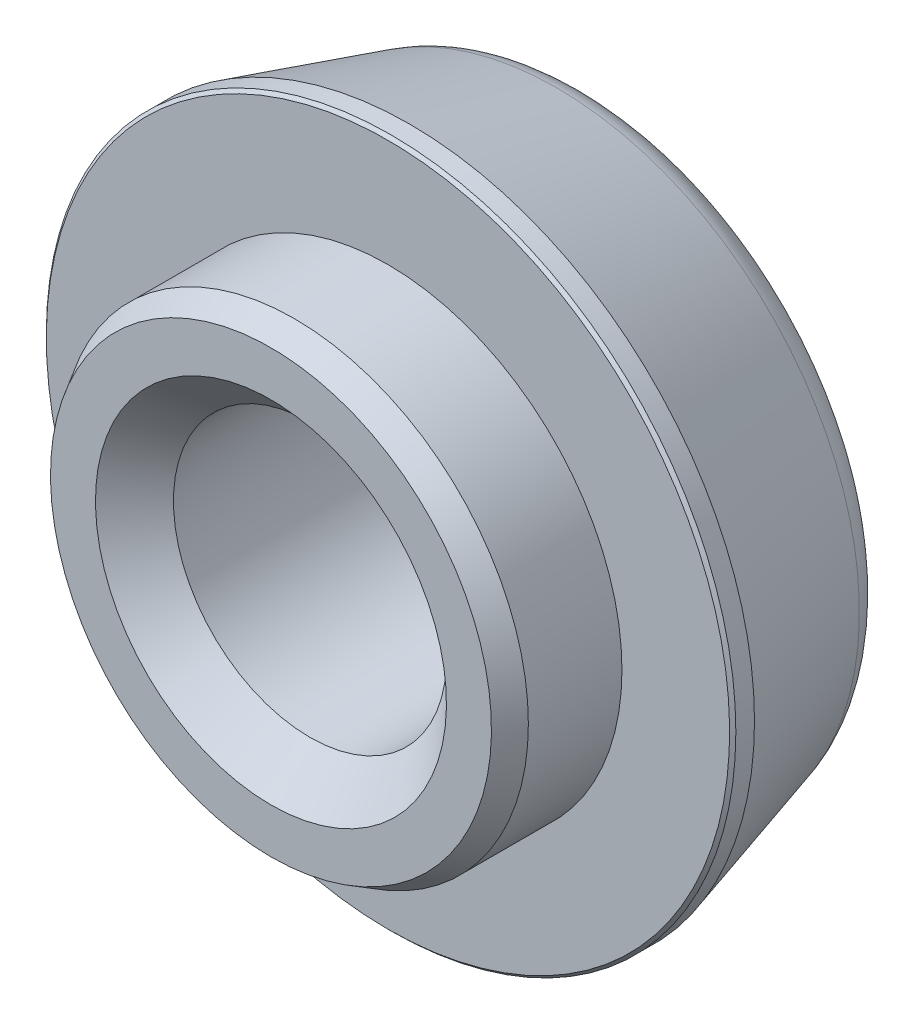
ISO-10303-21;
HEADER;
FILE_DESCRIPTION(('STEP AP214'),'2;1');
FILE_NAME('part.step','',(''),(''),'','','');
FILE_SCHEMA(('AUTOMOTIVE_DESIGN { 1 0 10303 214 1 1 1 1 }'));
ENDSEC;
DATA;
#1=APPLICATION_CONTEXT('core data for automotive mechanical design processes');
#2=APPLICATION_PROTOCOL_DEFINITION('international standard','automotive_design',2000,#1);
#3=PRODUCT_CONTEXT('',#1,'mechanical');
#4=PRODUCT('Part','Part','',(#3));
#5=PRODUCT_RELATED_PRODUCT_CATEGORY('part','',(#4));
#6=PRODUCT_DEFINITION_FORMATION('','',#4);
#7=PRODUCT_DEFINITION_CONTEXT('part definition',#1,'design');
#8=PRODUCT_DEFINITION('design','',#6,#7);
#9=PRODUCT_DEFINITION_SHAPE('','',#8);
#10=(LENGTH_UNIT() NAMED_UNIT(*) SI_UNIT(.MILLI.,.METRE.));
#11=(NAMED_UNIT(*) PLANE_ANGLE_UNIT() SI_UNIT($,.RADIAN.));
#12=(NAMED_UNIT(*) SI_UNIT($,.STERADIAN.) SOLID_ANGLE_UNIT());
#13=UNCERTAINTY_MEASURE_WITH_UNIT(LENGTH_MEASURE(1.E-05),#10,'distance_accuracy_value','');
#14=(GEOMETRIC_REPRESENTATION_CONTEXT(3) GLOBAL_UNCERTAINTY_ASSIGNED_CONTEXT((#13)) GLOBAL_UNIT_ASSIGNED_CONTEXT((#10,
#11,#12)) REPRESENTATION_CONTEXT('',''));
#15=CARTESIAN_POINT('',(0.,0.,0.));
#16=DIRECTION('',(0.,0.,1.));
#17=DIRECTION('',(1.,0.,0.));
#18=AXIS2_PLACEMENT_3D('',#15,#16,#17);
#19=CARTESIAN_POINT('',(0.,0.,0.));
#20=DIRECTION('',(0.,0.,-1.));
#21=DIRECTION('',(0.,1.,0.));
#22=AXIS2_PLACEMENT_3D('',#19,#20,#21);
#23=CYLINDRICAL_SURFACE('',#22,15.);
#24=CARTESIAN_POINT('',(0.,0.,6.));
#25=DIRECTION('',(0.,0.,1.));
#26=DIRECTION('',(0.,-1.,0.));
#27=AXIS2_PLACEMENT_3D('',#24,#25,#26);
#28=CIRCLE('',#27,15.);
#29=CARTESIAN_POINT('',(0.,-15.,5.99999999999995));
#30=VERTEX_POINT('',#29);
#31=EDGE_CURVE('E41',#30,#30,#28,.F.);
#32=ORIENTED_EDGE('',*,*,#31,.T.);
#33=EDGE_LOOP('',(#32));
#34=FACE_BOUND('',#33,.T.);
#35=CARTESIAN_POINT('',(0.,0.,0.));
#36=DIRECTION('',(0.,0.,-1.));
#37=DIRECTION('',(0.,1.,0.));
#38=AXIS2_PLACEMENT_3D('',#35,#36,#37);
#39=CIRCLE('',#38,15.);
#40=CARTESIAN_POINT('',(0.,15.,0.));
#41=VERTEX_POINT('',#40);
#42=EDGE_CURVE('E50',#41,#41,#39,.T.);
#43=ORIENTED_EDGE('',*,*,#42,.F.);
#44=EDGE_LOOP('',(#43));
#45=FACE_BOUND('',#44,.T.);
#46=ADVANCED_FACE('F12',(#34,#45),#23,.T.);
#47=CARTESIAN_POINT('',(15.,0.,0.));
#48=DIRECTION('',(0.,0.,1.));
#49=DIRECTION('',(0.,-1.,0.));
#50=AXIS2_PLACEMENT_3D('',#47,#48,#49);
#51=PLANE('',#50);
#52=CARTESIAN_POINT('',(0.,0.,0.));
#53=DIRECTION('',(0.,0.,1.));
#54=DIRECTION('',(0.,-1.,0.));
#55=AXIS2_PLACEMENT_3D('',#52,#53,#54);
#56=CIRCLE('',#55,21.9);
#57=CARTESIAN_POINT('',(0.,-21.9,0.));
#58=VERTEX_POINT('',#57);
#59=EDGE_CURVE('E8',#58,#58,#56,.T.);
#60=ORIENTED_EDGE('',*,*,#59,.T.);
#61=EDGE_LOOP('',(#60));
#62=FACE_BOUND('',#61,.T.);
#63=ORIENTED_EDGE('',*,*,#42,.T.);
#64=EDGE_LOOP('',(#63));
#65=FACE_BOUND('',#64,.T.);
#66=ADVANCED_FACE('F61',(#62,#65),#51,.T.);
#67=CARTESIAN_POINT('',(0.,0.,0.));
#68=DIRECTION('',(0.,0.,-1.));
#69=DIRECTION('',(0.,1.,0.));
#70=AXIS2_PLACEMENT_3D('',#67,#68,#69);
#71=CYLINDRICAL_SURFACE('',#70,22.1);
#72=CARTESIAN_POINT('',(0.,0.,-0.199999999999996));
#73=DIRECTION('',(0.,0.,1.));
#74=DIRECTION('',(0.,-1.,0.));
#75=AXIS2_PLACEMENT_3D('',#72,#73,#74);
#76=CIRCLE('',#75,22.1);
#77=CARTESIAN_POINT('',(0.,-22.1,-0.200000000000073));
#78=VERTEX_POINT('',#77);
#79=EDGE_CURVE('E19',#78,#78,#76,.F.);
#80=ORIENTED_EDGE('',*,*,#79,.T.);
#81=EDGE_LOOP('',(#80));
#82=FACE_BOUND('',#81,.T.);
#83=CARTESIAN_POINT('',(0.,0.,-1.3949657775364));
#84=DIRECTION('',(0.,0.,-1.));
#85=DIRECTION('',(0.,1.,0.));
#86=AXIS2_PLACEMENT_3D('',#83,#84,#85);
#87=CIRCLE('',#86,22.1);
#88=CARTESIAN_POINT('',(0.,22.1,-1.39496577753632));
#89=VERTEX_POINT('',#88);
#90=EDGE_CURVE('E53',#89,#89,#87,.T.);
#91=ORIENTED_EDGE('',*,*,#90,.F.);
#92=EDGE_LOOP('',(#91));
#93=FACE_BOUND('',#92,.T.);
#94=ADVANCED_FACE('F59',(#82,#93),#71,.T.);
#95=CARTESIAN_POINT('',(0.,0.,-13.));
#96=DIRECTION('',(0.,0.,1.));
#97=DIRECTION('',(0.,-1.,0.));
#98=AXIS2_PLACEMENT_3D('',#95,#96,#97);
#99=CONICAL_SURFACE('',#98,18.7723099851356,0.279252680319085);
#100=CARTESIAN_POINT('',(0.,0.,-10.826912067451));
#101=DIRECTION('',(0.,0.,-1.));
#102=DIRECTION('',(0.,1.,0.));
#103=AXIS2_PLACEMENT_3D('',#100,#101,#102);
#104=CIRCLE('',#103,19.3954329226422);
#105=CARTESIAN_POINT('',(0.,19.3954329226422,-10.8269120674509));
#106=VERTEX_POINT('',#105);
#107=EDGE_CURVE('E44',#106,#106,#104,.F.);
#108=ORIENTED_EDGE('',*,*,#107,.T.);
#109=EDGE_LOOP('',(#108));
#110=FACE_BOUND('',#109,.T.);
#111=ORIENTED_EDGE('',*,*,#90,.T.);
#112=EDGE_LOOP('',(#111));
#113=FACE_BOUND('',#112,.T.);
#114=ADVANCED_FACE('F57',(#110,#113),#99,.T.);
#115=CARTESIAN_POINT('',(8.75,0.,-13.));
#116=DIRECTION('',(0.,0.,-1.));
#117=DIRECTION('',(0.,1.,0.));
#118=AXIS2_PLACEMENT_3D('',#115,#116,#117);
#119=PLANE('',#118);
#120=CARTESIAN_POINT('',(0.,0.,-13.));
#121=DIRECTION('',(0.,0.,-1.));
#122=DIRECTION('',(0.,1.,0.));
#123=AXIS2_PLACEMENT_3D('',#120,#121,#122);
#124=CIRCLE('',#123,11.25);
#125=CARTESIAN_POINT('',(0.,11.25,-13.));
#126=VERTEX_POINT('',#125);
#127=EDGE_CURVE('E27',#126,#126,#124,.F.);
#128=ORIENTED_EDGE('',*,*,#127,.T.);
#129=EDGE_LOOP('',(#128));
#130=FACE_BOUND('',#129,.T.);
#131=CARTESIAN_POINT('',(0.,0.,-13.));
#132=DIRECTION('',(0.,0.,-1.));
#133=DIRECTION('',(0.,1.,0.));
#134=AXIS2_PLACEMENT_3D('',#131,#132,#133);
#135=CIRCLE('',#134,16.5116478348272);
#136=CARTESIAN_POINT('',(0.,16.5116478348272,-12.9999999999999));
#137=VERTEX_POINT('',#136);
#138=EDGE_CURVE('E47',#137,#137,#135,.T.);
#139=ORIENTED_EDGE('',*,*,#138,.T.);
#140=EDGE_LOOP('',(#139));
#141=FACE_BOUND('',#140,.T.);
#142=ADVANCED_FACE('F69',(#130,#141),#119,.T.);
#143=CARTESIAN_POINT('',(0.,0.,0.));
#144=DIRECTION('',(0.,0.,-1.));
#145=DIRECTION('',(0.,1.,0.));
#146=AXIS2_PLACEMENT_3D('',#143,#144,#145);
#147=CYLINDRICAL_SURFACE('',#146,8.75);
#148=CARTESIAN_POINT('',(0.,0.,-10.5));
#149=DIRECTION('',(0.,0.,-1.));
#150=DIRECTION('',(0.,1.,0.));
#151=AXIS2_PLACEMENT_3D('',#148,#149,#150);
#152=CIRCLE('',#151,8.75);
#153=CARTESIAN_POINT('',(0.,8.75000000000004,-10.5));
#154=VERTEX_POINT('',#153);
#155=EDGE_CURVE('E32',#154,#154,#152,.T.);
#156=ORIENTED_EDGE('',*,*,#155,.T.);
#157=EDGE_LOOP('',(#156));
#158=FACE_BOUND('',#157,.T.);
#159=CARTESIAN_POINT('',(0.,0.,5.));
#160=DIRECTION('',(0.,0.,1.));
#161=DIRECTION('',(0.,-1.,0.));
#162=AXIS2_PLACEMENT_3D('',#159,#160,#161);
#163=CIRCLE('',#162,8.75);
#164=CARTESIAN_POINT('',(0.,-8.75000000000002,4.99999999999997));
#165=VERTEX_POINT('',#164);
#166=EDGE_CURVE('E35',#165,#165,#163,.T.);
#167=ORIENTED_EDGE('',*,*,#166,.T.);
#168=EDGE_LOOP('',(#167));
#169=FACE_BOUND('',#168,.T.);
#170=ADVANCED_FACE('F107',(#158,#169),#147,.F.);
#171=CARTESIAN_POINT('',(8.75,0.,7.5));
#172=DIRECTION('',(0.,0.,1.));
#173=DIRECTION('',(0.,-1.,0.));
#174=AXIS2_PLACEMENT_3D('',#171,#172,#173);
#175=PLANE('',#174);
#176=CARTESIAN_POINT('',(0.,0.,7.5));
#177=DIRECTION('',(0.,0.,1.));
#178=DIRECTION('',(0.,-1.,0.));
#179=AXIS2_PLACEMENT_3D('',#176,#177,#178);
#180=CIRCLE('',#179,11.25);
#181=CARTESIAN_POINT('',(0.,-11.25,7.49999999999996));
#182=VERTEX_POINT('',#181);
#183=EDGE_CURVE('E23',#182,#182,#180,.F.);
#184=ORIENTED_EDGE('',*,*,#183,.T.);
#185=EDGE_LOOP('',(#184));
#186=FACE_BOUND('',#185,.T.);
#187=CARTESIAN_POINT('',(0.,0.,7.5));
#188=DIRECTION('',(0.,0.,1.));
#189=DIRECTION('',(0.,-1.,0.));
#190=AXIS2_PLACEMENT_3D('',#187,#188,#189);
#191=CIRCLE('',#190,14.1339745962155);
#192=CARTESIAN_POINT('',(0.,-14.1339745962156,7.49999999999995));
#193=VERTEX_POINT('',#192);
#194=EDGE_CURVE('E38',#193,#193,#191,.T.);
#195=ORIENTED_EDGE('',*,*,#194,.T.);
#196=EDGE_LOOP('',(#195));
#197=FACE_BOUND('',#196,.T.);
#198=ADVANCED_FACE('F85',(#186,#197),#175,.T.);
#199=CARTESIAN_POINT('',(0.,0.,-10.));
#200=DIRECTION('',(0.,0.,-1.));
#201=DIRECTION('',(0.,1.,0.));
#202=AXIS2_PLACEMENT_3D('',#199,#200,#201);
#203=TOROIDAL_SURFACE('',#202,16.5116478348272,3.);
#204=ORIENTED_EDGE('',*,*,#107,.F.);
#205=EDGE_LOOP('',(#204));
#206=FACE_BOUND('',#205,.T.);
#207=ORIENTED_EDGE('',*,*,#138,.F.);
#208=EDGE_LOOP('',(#207));
#209=FACE_BOUND('',#208,.T.);
#210=ADVANCED_FACE('F81',(#206,#209),#203,.T.);
#211=CARTESIAN_POINT('',(0.,0.,6.));
#212=DIRECTION('',(0.,0.,-1.));
#213=DIRECTION('',(0.,1.,0.));
#214=AXIS2_PLACEMENT_3D('',#211,#212,#213);
#215=CONICAL_SURFACE('',#214,15.,0.523598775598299);
#216=ORIENTED_EDGE('',*,*,#194,.F.);
#217=EDGE_LOOP('',(#216));
#218=FACE_BOUND('',#217,.T.);
#219=ORIENTED_EDGE('',*,*,#31,.F.);
#220=EDGE_LOOP('',(#219));
#221=FACE_BOUND('',#220,.T.);
#222=ADVANCED_FACE('F84',(#218,#221),#215,.T.);
#223=CARTESIAN_POINT('',(0.,0.,-10.5));
#224=DIRECTION('',(0.,0.,-1.));
#225=DIRECTION('',(0.,1.,0.));
#226=AXIS2_PLACEMENT_3D('',#223,#224,#225);
#227=CONICAL_SURFACE('',#226,8.75,0.78539816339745);
#228=ORIENTED_EDGE('',*,*,#127,.F.);
#229=EDGE_LOOP('',(#228));
#230=FACE_BOUND('',#229,.T.);
#231=ORIENTED_EDGE('',*,*,#155,.F.);
#232=EDGE_LOOP('',(#231));
#233=FACE_BOUND('',#232,.T.);
#234=ADVANCED_FACE('F89',(#230,#233),#227,.F.);
#235=CARTESIAN_POINT('',(0.,0.,7.5));
#236=DIRECTION('',(0.,0.,1.));
#237=DIRECTION('',(0.,-1.,0.));
#238=AXIS2_PLACEMENT_3D('',#235,#236,#237);
#239=CONICAL_SURFACE('',#238,11.25,0.785398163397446);
#240=ORIENTED_EDGE('',*,*,#166,.F.);
#241=EDGE_LOOP('',(#240));
#242=FACE_BOUND('',#241,.T.);
#243=ORIENTED_EDGE('',*,*,#183,.F.);
#244=EDGE_LOOP('',(#243));
#245=FACE_BOUND('',#244,.T.);
#246=ADVANCED_FACE('F92',(#242,#245),#239,.F.);
#247=CARTESIAN_POINT('',(0.,0.,-0.199999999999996));
#248=DIRECTION('',(0.,0.,-1.));
#249=DIRECTION('',(0.,1.,0.));
#250=AXIS2_PLACEMENT_3D('',#247,#248,#249);
#251=CONICAL_SURFACE('',#250,22.1,0.785398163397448);
#252=ORIENTED_EDGE('',*,*,#59,.F.);
#253=EDGE_LOOP('',(#252));
#254=FACE_BOUND('',#253,.T.);
#255=ORIENTED_EDGE('',*,*,#79,.F.);
#256=EDGE_LOOP('',(#255));
#257=FACE_BOUND('',#256,.T.);
#258=ADVANCED_FACE('F14',(#254,#257),#251,.T.);
#259=CLOSED_SHELL('',(#46,#66,#94,#114,#142,#170,#198,#210,#222,#234,#246,#258));
#260=MANIFOLD_SOLID_BREP('B1',#259);
#261=ADVANCED_BREP_SHAPE_REPRESENTATION('',(#18,#260),#14);
#262=SHAPE_DEFINITION_REPRESENTATION(#9,#261);
ENDSEC;
END-ISO-10303-21;
